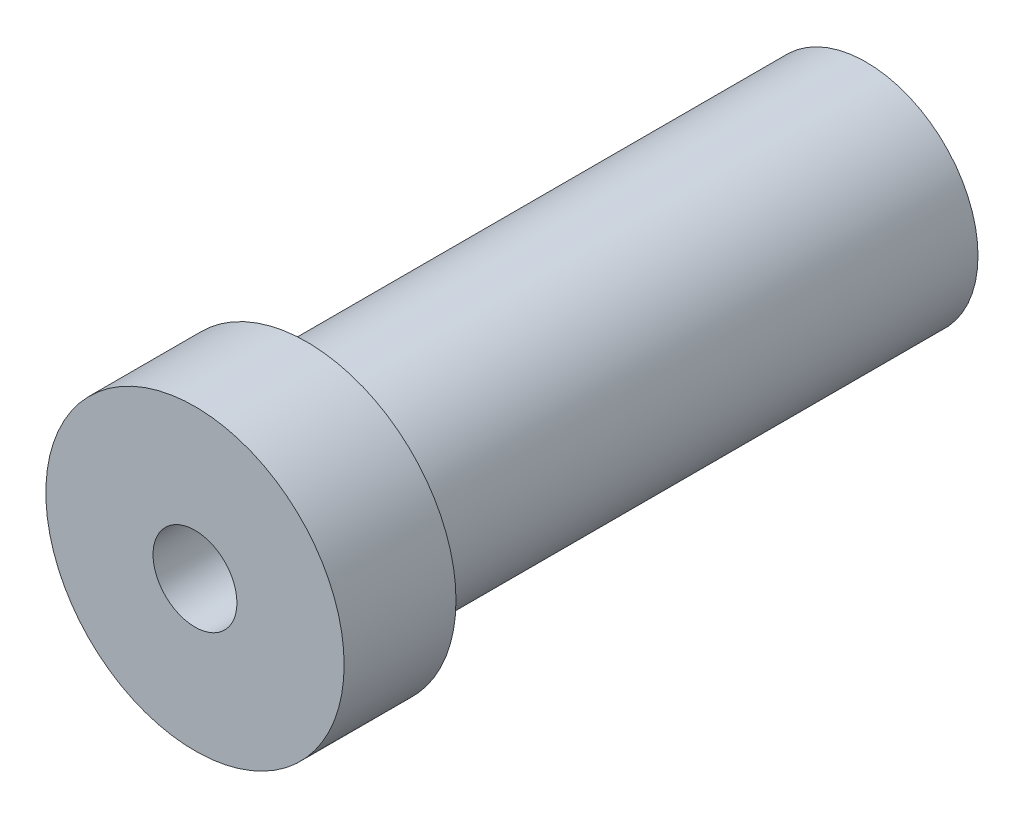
ISO-10303-21;
HEADER;
FILE_DESCRIPTION(('STEP AP214'),'2;1');
FILE_NAME('part.step','',(''),(''),'','','');
FILE_SCHEMA(('AUTOMOTIVE_DESIGN { 1 0 10303 214 1 1 1 1 }'));
ENDSEC;
DATA;
#1=APPLICATION_CONTEXT('core data for automotive mechanical design processes');
#2=APPLICATION_PROTOCOL_DEFINITION('international standard','automotive_design',2000,#1);
#3=PRODUCT_CONTEXT('',#1,'mechanical');
#4=PRODUCT('Part','Part','',(#3));
#5=PRODUCT_RELATED_PRODUCT_CATEGORY('part','',(#4));
#6=PRODUCT_DEFINITION_FORMATION('','',#4);
#7=PRODUCT_DEFINITION_CONTEXT('part definition',#1,'design');
#8=PRODUCT_DEFINITION('design','',#6,#7);
#9=PRODUCT_DEFINITION_SHAPE('','',#8);
#10=(LENGTH_UNIT() NAMED_UNIT(*) SI_UNIT(.MILLI.,.METRE.));
#11=(NAMED_UNIT(*) PLANE_ANGLE_UNIT() SI_UNIT($,.RADIAN.));
#12=(NAMED_UNIT(*) SI_UNIT($,.STERADIAN.) SOLID_ANGLE_UNIT());
#13=UNCERTAINTY_MEASURE_WITH_UNIT(LENGTH_MEASURE(1.E-05),#10,'distance_accuracy_value','');
#14=(GEOMETRIC_REPRESENTATION_CONTEXT(3) GLOBAL_UNCERTAINTY_ASSIGNED_CONTEXT((#13)) GLOBAL_UNIT_ASSIGNED_CONTEXT((#10,
#11,#12)) REPRESENTATION_CONTEXT('',''));
#15=CARTESIAN_POINT('',(0.,0.,0.));
#16=DIRECTION('',(0.,0.,1.));
#17=DIRECTION('',(1.,0.,0.));
#18=AXIS2_PLACEMENT_3D('',#15,#16,#17);
#19=CARTESIAN_POINT('',(0.,0.,0.));
#20=DIRECTION('',(0.,0.,1.));
#21=DIRECTION('',(1.,0.,0.));
#22=AXIS2_PLACEMENT_3D('',#19,#20,#21);
#23=CYLINDRICAL_SURFACE('',#22,8.);
#24=CARTESIAN_POINT('',(0.,0.,0.));
#25=DIRECTION('',(0.,0.,1.));
#26=DIRECTION('',(1.,0.,0.));
#27=AXIS2_PLACEMENT_3D('',#24,#25,#26);
#28=CIRCLE('',#27,8.);
#29=CARTESIAN_POINT('',(8.,0.,0.));
#30=VERTEX_POINT('',#29);
#31=EDGE_CURVE('E74',#30,#30,#28,.T.);
#32=ORIENTED_EDGE('',*,*,#31,.F.);
#33=EDGE_LOOP('',(#32));
#34=FACE_BOUND('',#33,.T.);
#35=CARTESIAN_POINT('',(0.,0.,-6.));
#36=DIRECTION('',(0.,0.,1.));
#37=DIRECTION('',(1.,0.,0.));
#38=AXIS2_PLACEMENT_3D('',#35,#36,#37);
#39=CIRCLE('',#38,8.);
#40=CARTESIAN_POINT('',(8.,0.,-6.));
#41=VERTEX_POINT('',#40);
#42=EDGE_CURVE('E77',#41,#41,#39,.T.);
#43=ORIENTED_EDGE('',*,*,#42,.T.);
#44=EDGE_LOOP('',(#43));
#45=FACE_BOUND('',#44,.T.);
#46=CARTESIAN_POINT('',(-8.,0.,-1.));
#47=CARTESIAN_POINT('',(-7.99999813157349,0.110501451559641,-1.00000310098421));
#48=CARTESIAN_POINT('',(-7.99768770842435,0.221037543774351,-1.00918873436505));
#49=CARTESIAN_POINT('',(-7.98869485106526,0.438941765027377,-1.04563353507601));
#50=CARTESIAN_POINT('',(-7.98200993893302,0.546308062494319,-1.07290294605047));
#51=CARTESIAN_POINT('',(-7.96500835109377,0.754694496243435,-1.14458567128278));
#52=CARTESIAN_POINT('',(-7.95469603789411,0.855722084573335,-1.18897839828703));
#53=CARTESIAN_POINT('',(-7.93153791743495,1.04889617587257,-1.29357518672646));
#54=CARTESIAN_POINT('',(-7.91869202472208,1.14104237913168,-1.35377978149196));
#55=CARTESIAN_POINT('',(-7.89156551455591,1.31573590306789,-1.48960105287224));
#56=CARTESIAN_POINT('',(-7.87726276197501,1.39807425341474,-1.56548209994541));
#57=CARTESIAN_POINT('',(-7.84898160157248,1.54899856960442,-1.72993627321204));
#58=CARTESIAN_POINT('',(-7.83500323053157,1.61758298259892,-1.81851083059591));
#59=CARTESIAN_POINT('',(-7.80873034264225,1.74003539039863,-2.00746030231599));
#60=CARTESIAN_POINT('',(-7.79646392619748,1.79366962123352,-2.10799097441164));
#61=CARTESIAN_POINT('',(-7.77532659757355,1.88319587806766,-2.31699788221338));
#62=CARTESIAN_POINT('',(-7.76645514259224,1.91909074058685,-2.42547284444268));
#63=CARTESIAN_POINT('',(-7.7533396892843,1.97140644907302,-2.64499133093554));
#64=CARTESIAN_POINT('',(-7.74900654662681,1.98820302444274,-2.75593986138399));
#65=CARTESIAN_POINT('',(-7.74519149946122,2.00301570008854,-2.97915809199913));
#66=CARTESIAN_POINT('',(-7.74570880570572,2.00103485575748,-3.09142757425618));
#67=CARTESIAN_POINT('',(-7.75145607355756,1.97864869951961,-3.3112210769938));
#68=CARTESIAN_POINT('',(-7.75657150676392,1.95869112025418,-3.41879416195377));
#69=CARTESIAN_POINT('',(-7.77075612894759,1.90163224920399,-3.62901473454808));
#70=CARTESIAN_POINT('',(-7.77982559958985,1.86452973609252,-3.73166187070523));
#71=CARTESIAN_POINT('',(-7.80100151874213,1.77385263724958,-3.93031735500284));
#72=CARTESIAN_POINT('',(-7.81313769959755,1.72011555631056,-4.02624822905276));
#73=CARTESIAN_POINT('',(-7.83906281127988,1.59780836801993,-4.2078916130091));
#74=CARTESIAN_POINT('',(-7.85285203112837,1.52923566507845,-4.29360233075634));
#75=CARTESIAN_POINT('',(-7.88101174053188,1.37688456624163,-4.45493815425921));
#76=CARTESIAN_POINT('',(-7.89538759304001,1.29272834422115,-4.53020598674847));
#77=CARTESIAN_POINT('',(-7.92274620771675,1.11281589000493,-4.6656283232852));
#78=CARTESIAN_POINT('',(-7.93572892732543,1.01705930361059,-4.72578236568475));
#79=CARTESIAN_POINT('',(-7.9589030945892,0.816154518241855,-4.82940078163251));
#80=CARTESIAN_POINT('',(-7.96908480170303,0.71097519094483,-4.87280712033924));
#81=CARTESIAN_POINT('',(-7.98543889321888,0.49450134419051,-4.94122307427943));
#82=CARTESIAN_POINT('',(-7.99161204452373,0.383207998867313,-4.96623620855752));
#83=CARTESIAN_POINT('',(-7.999139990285,0.160719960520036,-4.99661008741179));
#84=CARTESIAN_POINT('',(-8.00061404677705,0.0495956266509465,-5.0024573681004));
#85=CARTESIAN_POINT('',(-7.99891739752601,-0.172043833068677,-4.99566799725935));
#86=CARTESIAN_POINT('',(-7.99574710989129,-0.28255901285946,-4.98303300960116));
#87=CARTESIAN_POINT('',(-7.98519441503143,-0.498152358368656,-4.94003878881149));
#88=CARTESIAN_POINT('',(-7.97787512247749,-0.603286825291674,-4.90994498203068));
#89=CARTESIAN_POINT('',(-7.95984942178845,-0.807009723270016,-4.83319055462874));
#90=CARTESIAN_POINT('',(-7.94914267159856,-0.905597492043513,-4.78652826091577));
#91=CARTESIAN_POINT('',(-7.92524410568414,-1.0953641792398,-4.67701849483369));
#92=CARTESIAN_POINT('',(-7.91201156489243,-1.18638058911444,-4.61389851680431));
#93=CARTESIAN_POINT('',(-7.88459345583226,-1.35670215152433,-4.47361345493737));
#94=CARTESIAN_POINT('',(-7.87040772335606,-1.43600527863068,-4.39644594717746));
#95=CARTESIAN_POINT('',(-7.84225275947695,-1.58265409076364,-4.22799738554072));
#96=CARTESIAN_POINT('',(-7.82829738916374,-1.64965849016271,-4.13641639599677));
#97=CARTESIAN_POINT('',(-7.80257171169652,-1.7673476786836,-3.94302315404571));
#98=CARTESIAN_POINT('',(-7.79080130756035,-1.81803319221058,-3.84121135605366));
#99=CARTESIAN_POINT('',(-7.77090792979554,-1.90126856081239,-3.63079237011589));
#100=CARTESIAN_POINT('',(-7.76276340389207,-1.93392586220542,-3.52222982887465));
#101=CARTESIAN_POINT('',(-7.75102325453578,-1.98046087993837,-3.30092048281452));
#102=CARTESIAN_POINT('',(-7.74742663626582,-1.99434270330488,-3.18817459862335));
#103=CARTESIAN_POINT('',(-7.74526534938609,-2.00271812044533,-2.96517196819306));
#104=CARTESIAN_POINT('',(-7.74655910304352,-1.99775719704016,-2.85493675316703));
#105=CARTESIAN_POINT('',(-7.7537054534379,-1.96983637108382,-2.63692814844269));
#106=CARTESIAN_POINT('',(-7.75955795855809,-1.94687683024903,-2.52915470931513));
#107=CARTESIAN_POINT('',(-7.77508347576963,-1.88390842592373,-2.31972205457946));
#108=CARTESIAN_POINT('',(-7.78473353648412,-1.84400187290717,-2.21803025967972));
#109=CARTESIAN_POINT('',(-7.80677007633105,-1.74835321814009,-2.02271282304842));
#110=CARTESIAN_POINT('',(-7.81915693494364,-1.69260892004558,-1.92908830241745));
#111=CARTESIAN_POINT('',(-7.8456751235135,-1.56515699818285,-1.74992716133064));
#112=CARTESIAN_POINT('',(-7.85984353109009,-1.49307088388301,-1.66466523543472));
#113=CARTESIAN_POINT('',(-7.88810702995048,-1.33571916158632,-1.50727060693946));
#114=CARTESIAN_POINT('',(-7.90220210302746,-1.25045042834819,-1.43514102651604));
#115=CARTESIAN_POINT('',(-7.9290354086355,-1.06729011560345,-1.30478492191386));
#116=CARTESIAN_POINT('',(-7.94174444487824,-0.96919789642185,-1.2468338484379));
#117=CARTESIAN_POINT('',(-7.96406566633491,-0.764354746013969,-1.14833671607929));
#118=CARTESIAN_POINT('',(-7.97368006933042,-0.65761008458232,-1.10777818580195));
#119=CARTESIAN_POINT('',(-7.98730746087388,-0.459213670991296,-1.05123755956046));
#120=CARTESIAN_POINT('',(-7.9920344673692,-0.368506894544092,-1.03206500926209));
#121=CARTESIAN_POINT('',(-7.99838140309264,-0.185208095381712,-1.00644540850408));
#122=CARTESIAN_POINT('',(-8.00000156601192,-0.0926162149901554,-0.999997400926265));
#123=CARTESIAN_POINT('',(-8.,0.,-1.));
#124=B_SPLINE_CURVE_WITH_KNOTS('',3,(#46,#47,#48,#49,#50,#51,#52,#53,#54,#55,#56,#57,#58,#59,
#60,#61,#62,#63,#64,#65,#66,#67,#68,#69,#70,#71,#72,#73,#74,#75,#76,#77,#78,#79,#80,#81,#82,#83,
#84,#85,#86,#87,#88,#89,#90,#91,#92,#93,#94,#95,#96,#97,#98,#99,#100,#101,#102,#103,#104,#105,
#106,#107,#108,#109,#110,#111,#112,#113,#114,#115,#116,#117,#118,#119,#120,#121,#122,#123),
.UNSPECIFIED.,.T.,.F.,(4,2,2,2,2,2,2,2,2,2,2,2,2,2,2,2,2,2,2,2,2,2,2,2,2,2,2,2,2,2,2,2,2,2,2,2,
2,2,4),(0.,0.331164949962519,0.662517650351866,0.99347320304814,1.32443992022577,
1.66152580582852,1.99864972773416,2.34078196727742,2.68285948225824,3.01808393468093,
3.3532538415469,3.68029996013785,4.00736937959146,4.337740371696,4.66816921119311,
5.00802001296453,5.34788119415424,5.6889097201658,6.02987298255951,6.36211078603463,
6.69431868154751,7.02160366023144,7.34892169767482,7.68204783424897,8.01523150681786,
8.35659345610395,8.69794025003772,9.03723006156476,9.37644564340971,9.70591707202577,
10.0353818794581,10.3628853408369,10.6904342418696,11.0265276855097,11.3627009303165,
11.7049624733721,12.0469781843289,12.3245632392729,12.6021274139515),.UNSPECIFIED.);
#125=CARTESIAN_POINT('',(-8.,0.,-1.));
#126=VERTEX_POINT('',#125);
#127=EDGE_CURVE('E10',#126,#126,#124,.T.);
#128=ORIENTED_EDGE('',*,*,#127,.F.);
#129=EDGE_LOOP('',(#128));
#130=FACE_BOUND('',#129,.T.);
#131=ADVANCED_FACE('F16',(#34,#45,#130),#23,.T.);
#132=CARTESIAN_POINT('',(0.,2.25,-18.));
#133=DIRECTION('',(0.,0.,-1.));
#134=DIRECTION('',(-1.,0.,0.));
#135=AXIS2_PLACEMENT_3D('',#132,#133,#134);
#136=PLANE('',#135);
#137=CARTESIAN_POINT('',(0.,0.,-18.));
#138=DIRECTION('',(0.,0.,1.));
#139=DIRECTION('',(1.,0.,0.));
#140=AXIS2_PLACEMENT_3D('',#137,#138,#139);
#141=CIRCLE('',#140,2.);
#142=CARTESIAN_POINT('',(2.,0.,-18.));
#143=VERTEX_POINT('',#142);
#144=EDGE_CURVE('E100',#143,#143,#141,.T.);
#145=ORIENTED_EDGE('',*,*,#144,.F.);
#146=EDGE_LOOP('',(#145));
#147=FACE_BOUND('',#146,.T.);
#148=CARTESIAN_POINT('',(0.,0.,-18.));
#149=DIRECTION('',(0.,0.,1.));
#150=DIRECTION('',(1.,0.,0.));
#151=AXIS2_PLACEMENT_3D('',#148,#149,#150);
#152=CIRCLE('',#151,2.25);
#153=CARTESIAN_POINT('',(2.25,0.,-18.));
#154=VERTEX_POINT('',#153);
#155=EDGE_CURVE('E28',#154,#154,#152,.T.);
#156=ORIENTED_EDGE('',*,*,#155,.T.);
#157=EDGE_LOOP('',(#156));
#158=FACE_BOUND('',#157,.T.);
#159=ADVANCED_FACE('F18',(#147,#158),#136,.F.);
#160=CARTESIAN_POINT('',(0.,0.,0.));
#161=DIRECTION('',(0.,0.,1.));
#162=DIRECTION('',(1.,0.,0.));
#163=AXIS2_PLACEMENT_3D('',#160,#161,#162);
#164=CYLINDRICAL_SURFACE('',#163,2.25);
#165=ORIENTED_EDGE('',*,*,#155,.F.);
#166=EDGE_LOOP('',(#165));
#167=FACE_BOUND('',#166,.T.);
#168=CARTESIAN_POINT('',(0.,0.,0.));
#169=DIRECTION('',(0.,0.,1.));
#170=DIRECTION('',(1.,0.,0.));
#171=AXIS2_PLACEMENT_3D('',#168,#169,#170);
#172=CIRCLE('',#171,2.25);
#173=CARTESIAN_POINT('',(2.25,0.,0.));
#174=VERTEX_POINT('',#173);
#175=EDGE_CURVE('E73',#174,#174,#172,.T.);
#176=ORIENTED_EDGE('',*,*,#175,.T.);
#177=EDGE_LOOP('',(#176));
#178=FACE_BOUND('',#177,.T.);
#179=ADVANCED_FACE('F51',(#167,#178),#164,.F.);
#180=CARTESIAN_POINT('',(0.,2.25,0.));
#181=DIRECTION('',(0.,0.,-1.));
#182=DIRECTION('',(-1.,0.,0.));
#183=AXIS2_PLACEMENT_3D('',#180,#181,#182);
#184=PLANE('',#183);
#185=ORIENTED_EDGE('',*,*,#175,.F.);
#186=EDGE_LOOP('',(#185));
#187=FACE_BOUND('',#186,.T.);
#188=ORIENTED_EDGE('',*,*,#31,.T.);
#189=EDGE_LOOP('',(#188));
#190=FACE_BOUND('',#189,.T.);
#191=ADVANCED_FACE('F60',(#187,#190),#184,.F.);
#192=CARTESIAN_POINT('',(0.,8.,-6.));
#193=DIRECTION('',(0.,0.,1.));
#194=DIRECTION('',(1.,0.,0.));
#195=AXIS2_PLACEMENT_3D('',#192,#193,#194);
#196=PLANE('',#195);
#197=ORIENTED_EDGE('',*,*,#42,.F.);
#198=EDGE_LOOP('',(#197));
#199=FACE_BOUND('',#198,.T.);
#200=CARTESIAN_POINT('',(0.,0.,-6.));
#201=DIRECTION('',(0.,0.,1.));
#202=DIRECTION('',(1.,0.,0.));
#203=AXIS2_PLACEMENT_3D('',#200,#201,#202);
#204=CIRCLE('',#203,6.);
#205=CARTESIAN_POINT('',(6.,0.,-6.));
#206=VERTEX_POINT('',#205);
#207=EDGE_CURVE('E82',#206,#206,#204,.T.);
#208=ORIENTED_EDGE('',*,*,#207,.T.);
#209=EDGE_LOOP('',(#208));
#210=FACE_BOUND('',#209,.T.);
#211=ADVANCED_FACE('F58',(#199,#210),#196,.F.);
#212=CARTESIAN_POINT('',(0.,0.,0.));
#213=DIRECTION('',(0.,0.,1.));
#214=DIRECTION('',(1.,0.,0.));
#215=AXIS2_PLACEMENT_3D('',#212,#213,#214);
#216=CYLINDRICAL_SURFACE('',#215,6.);
#217=ORIENTED_EDGE('',*,*,#207,.F.);
#218=EDGE_LOOP('',(#217));
#219=FACE_BOUND('',#218,.T.);
#220=CARTESIAN_POINT('',(0.,0.,-36.));
#221=DIRECTION('',(0.,0.,1.));
#222=DIRECTION('',(1.,0.,0.));
#223=AXIS2_PLACEMENT_3D('',#220,#221,#222);
#224=CIRCLE('',#223,6.);
#225=CARTESIAN_POINT('',(6.,0.,-36.));
#226=VERTEX_POINT('',#225);
#227=EDGE_CURVE('E85',#226,#226,#224,.T.);
#228=ORIENTED_EDGE('',*,*,#227,.T.);
#229=EDGE_LOOP('',(#228));
#230=FACE_BOUND('',#229,.T.);
#231=ADVANCED_FACE('F132',(#219,#230),#216,.T.);
#232=CARTESIAN_POINT('',(0.,6.,-36.));
#233=DIRECTION('',(0.,0.,1.));
#234=DIRECTION('',(1.,0.,0.));
#235=AXIS2_PLACEMENT_3D('',#232,#233,#234);
#236=PLANE('',#235);
#237=ORIENTED_EDGE('',*,*,#227,.F.);
#238=EDGE_LOOP('',(#237));
#239=FACE_BOUND('',#238,.T.);
#240=CARTESIAN_POINT('',(0.,0.,-36.));
#241=DIRECTION('',(0.,0.,1.));
#242=DIRECTION('',(1.,0.,0.));
#243=AXIS2_PLACEMENT_3D('',#240,#241,#242);
#244=CIRCLE('',#243,2.1);
#245=CARTESIAN_POINT('',(2.1,0.,-36.));
#246=VERTEX_POINT('',#245);
#247=EDGE_CURVE('E88',#246,#246,#244,.T.);
#248=ORIENTED_EDGE('',*,*,#247,.T.);
#249=EDGE_LOOP('',(#248));
#250=FACE_BOUND('',#249,.T.);
#251=ADVANCED_FACE('F129',(#239,#250),#236,.F.);
#252=CARTESIAN_POINT('',(0.,0.,0.));
#253=DIRECTION('',(0.,0.,1.));
#254=DIRECTION('',(1.,0.,0.));
#255=AXIS2_PLACEMENT_3D('',#252,#253,#254);
#256=CYLINDRICAL_SURFACE('',#255,2.1);
#257=ORIENTED_EDGE('',*,*,#247,.F.);
#258=EDGE_LOOP('',(#257));
#259=FACE_BOUND('',#258,.T.);
#260=CARTESIAN_POINT('',(0.,0.,-34.));
#261=DIRECTION('',(0.,0.,1.));
#262=DIRECTION('',(1.,0.,0.));
#263=AXIS2_PLACEMENT_3D('',#260,#261,#262);
#264=CIRCLE('',#263,2.1);
#265=CARTESIAN_POINT('',(2.1,0.,-34.));
#266=VERTEX_POINT('',#265);
#267=EDGE_CURVE('E91',#266,#266,#264,.T.);
#268=ORIENTED_EDGE('',*,*,#267,.T.);
#269=EDGE_LOOP('',(#268));
#270=FACE_BOUND('',#269,.T.);
#271=ADVANCED_FACE('F125',(#259,#270),#256,.F.);
#272=CARTESIAN_POINT('',(0.,0.,-29.));
#273=DIRECTION('',(0.,0.,1.));
#274=DIRECTION('',(1.,0.,0.));
#275=AXIS2_PLACEMENT_3D('',#272,#273,#274);
#276=CONICAL_SURFACE('',#275,2.53744331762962,0.0872664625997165);
#277=ORIENTED_EDGE('',*,*,#267,.F.);
#278=EDGE_LOOP('',(#277));
#279=FACE_BOUND('',#278,.T.);
#280=CARTESIAN_POINT('',(0.,0.,-29.));
#281=DIRECTION('',(0.,0.,1.));
#282=DIRECTION('',(1.,0.,0.));
#283=AXIS2_PLACEMENT_3D('',#280,#281,#282);
#284=CIRCLE('',#283,2.53744331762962);
#285=CARTESIAN_POINT('',(2.53744331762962,0.,-29.));
#286=VERTEX_POINT('',#285);
#287=EDGE_CURVE('E94',#286,#286,#284,.T.);
#288=ORIENTED_EDGE('',*,*,#287,.T.);
#289=EDGE_LOOP('',(#288));
#290=FACE_BOUND('',#289,.T.);
#291=ADVANCED_FACE('F118',(#279,#290),#276,.F.);
#292=CARTESIAN_POINT('',(0.,2.53744331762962,-29.));
#293=DIRECTION('',(0.,0.,1.));
#294=DIRECTION('',(1.,0.,0.));
#295=AXIS2_PLACEMENT_3D('',#292,#293,#294);
#296=PLANE('',#295);
#297=ORIENTED_EDGE('',*,*,#287,.F.);
#298=EDGE_LOOP('',(#297));
#299=FACE_BOUND('',#298,.T.);
#300=CARTESIAN_POINT('',(0.,0.,-29.));
#301=DIRECTION('',(0.,0.,1.));
#302=DIRECTION('',(1.,0.,0.));
#303=AXIS2_PLACEMENT_3D('',#300,#301,#302);
#304=CIRCLE('',#303,2.);
#305=CARTESIAN_POINT('',(2.,0.,-29.));
#306=VERTEX_POINT('',#305);
#307=EDGE_CURVE('E97',#306,#306,#304,.T.);
#308=ORIENTED_EDGE('',*,*,#307,.T.);
#309=EDGE_LOOP('',(#308));
#310=FACE_BOUND('',#309,.T.);
#311=ADVANCED_FACE('F112',(#299,#310),#296,.F.);
#312=CARTESIAN_POINT('',(0.,0.,0.));
#313=DIRECTION('',(0.,0.,1.));
#314=DIRECTION('',(1.,0.,0.));
#315=AXIS2_PLACEMENT_3D('',#312,#313,#314);
#316=CYLINDRICAL_SURFACE('',#315,2.);
#317=ORIENTED_EDGE('',*,*,#307,.F.);
#318=EDGE_LOOP('',(#317));
#319=FACE_BOUND('',#318,.T.);
#320=ORIENTED_EDGE('',*,*,#144,.T.);
#321=EDGE_LOOP('',(#320));
#322=FACE_BOUND('',#321,.T.);
#323=ADVANCED_FACE('F41',(#319,#322),#316,.F.);
#324=CARTESIAN_POINT('',(-8.,0.,-3.));
#325=DIRECTION('',(-1.,0.,0.));
#326=DIRECTION('',(0.,0.,1.));
#327=AXIS2_PLACEMENT_3D('',#324,#325,#326);
#328=CYLINDRICAL_SURFACE('',#327,2.);
#329=CARTESIAN_POINT('',(-3.5,0.,-3.));
#330=DIRECTION('',(-1.,0.,0.));
#331=DIRECTION('',(0.,0.,1.));
#332=AXIS2_PLACEMENT_3D('',#329,#330,#331);
#333=CIRCLE('',#332,2.);
#334=CARTESIAN_POINT('',(-3.5,0.,-1.));
#335=VERTEX_POINT('',#334);
#336=EDGE_CURVE('E103',#335,#335,#333,.T.);
#337=ORIENTED_EDGE('',*,*,#336,.F.);
#338=EDGE_LOOP('',(#337));
#339=FACE_BOUND('',#338,.T.);
#340=ORIENTED_EDGE('',*,*,#127,.T.);
#341=EDGE_LOOP('',(#340));
#342=FACE_BOUND('',#341,.T.);
#343=ADVANCED_FACE('F33',(#339,#342),#328,.F.);
#344=CARTESIAN_POINT('',(-2.34529946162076,0.,-3.));
#345=DIRECTION('',(-1.,0.,0.));
#346=DIRECTION('',(0.,0.,1.));
#347=AXIS2_PLACEMENT_3D('',#344,#345,#346);
#348=CONICAL_SURFACE('',#347,0.,1.0471975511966);
#349=ORIENTED_EDGE('',*,*,#336,.T.);
#350=EDGE_LOOP('',(#349));
#351=FACE_BOUND('',#350,.T.);
#352=CARTESIAN_POINT('',(-2.34529946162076,0.,-3.));
#353=VERTEX_POINT('',#352);
#354=VERTEX_LOOP('',#353);
#355=FACE_BOUND('',#354,.T.);
#356=ADVANCED_FACE('F31',(#351,#355),#348,.F.);
#357=CLOSED_SHELL('',(#131,#159,#179,#191,#211,#231,#251,#271,#291,#311,#323,#343,#356));
#358=MANIFOLD_SOLID_BREP('B1',#357);
#359=ADVANCED_BREP_SHAPE_REPRESENTATION('',(#18,#358),#14);
#360=SHAPE_DEFINITION_REPRESENTATION(#9,#359);
ENDSEC;
END-ISO-10303-21;
